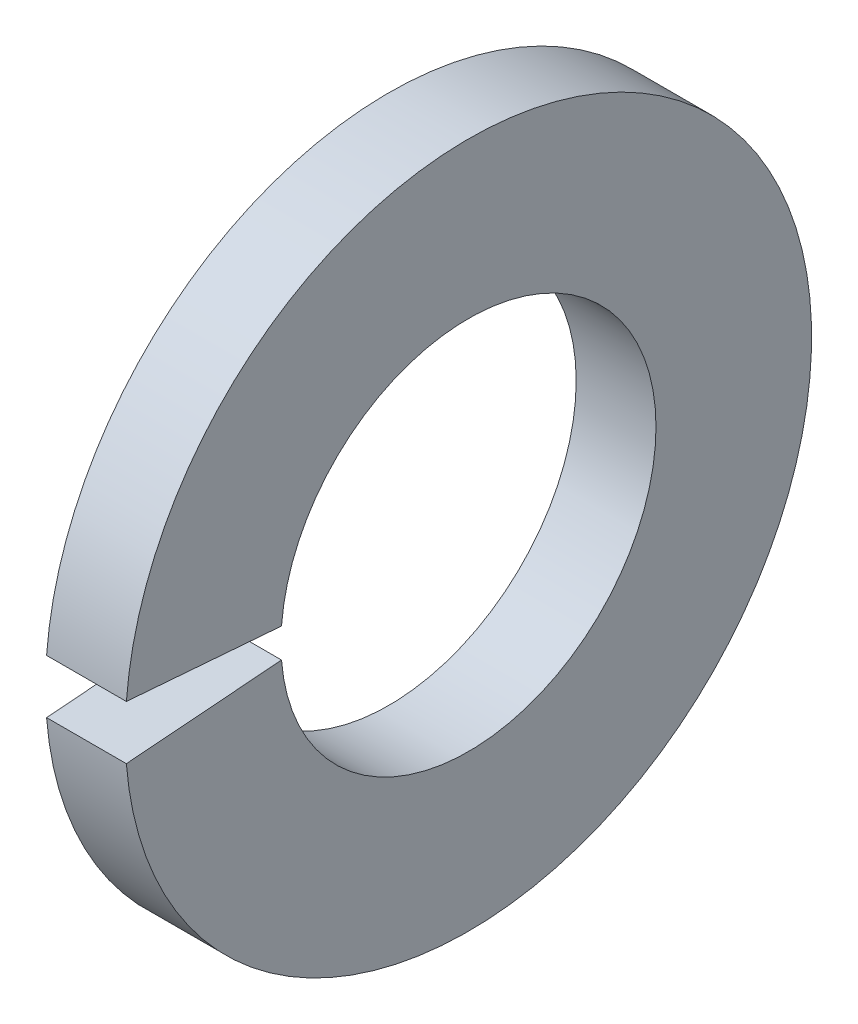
ISO-10303-21;
HEADER;
FILE_DESCRIPTION(('STEP AP214'),'2;1');
FILE_NAME('part.step','',(''),(''),'','','');
FILE_SCHEMA(('AUTOMOTIVE_DESIGN { 1 0 10303 214 1 1 1 1 }'));
ENDSEC;
DATA;
#1=APPLICATION_CONTEXT('core data for automotive mechanical design processes');
#2=APPLICATION_PROTOCOL_DEFINITION('international standard','automotive_design',2000,#1);
#3=PRODUCT_CONTEXT('',#1,'mechanical');
#4=PRODUCT('Part','Part','',(#3));
#5=PRODUCT_RELATED_PRODUCT_CATEGORY('part','',(#4));
#6=PRODUCT_DEFINITION_FORMATION('','',#4);
#7=PRODUCT_DEFINITION_CONTEXT('part definition',#1,'design');
#8=PRODUCT_DEFINITION('design','',#6,#7);
#9=PRODUCT_DEFINITION_SHAPE('','',#8);
#10=(LENGTH_UNIT() NAMED_UNIT(*) SI_UNIT(.MILLI.,.METRE.));
#11=(NAMED_UNIT(*) PLANE_ANGLE_UNIT() SI_UNIT($,.RADIAN.));
#12=(NAMED_UNIT(*) SI_UNIT($,.STERADIAN.) SOLID_ANGLE_UNIT());
#13=UNCERTAINTY_MEASURE_WITH_UNIT(LENGTH_MEASURE(1.E-05),#10,'distance_accuracy_value','');
#14=(GEOMETRIC_REPRESENTATION_CONTEXT(3) GLOBAL_UNCERTAINTY_ASSIGNED_CONTEXT((#13)) GLOBAL_UNIT_ASSIGNED_CONTEXT((#10,
#11,#12)) REPRESENTATION_CONTEXT('',''));
#15=CARTESIAN_POINT('',(0.,0.,0.));
#16=DIRECTION('',(0.,0.,1.));
#17=DIRECTION('',(1.,0.,0.));
#18=AXIS2_PLACEMENT_3D('',#15,#16,#17);
#19=CARTESIAN_POINT('',(-34.925,0.,0.));
#20=DIRECTION('',(-1.,0.,0.));
#21=DIRECTION('',(0.,0.,1.));
#22=AXIS2_PLACEMENT_3D('',#19,#20,#21);
#23=CYLINDRICAL_SURFACE('',#22,1.1938);
#24=CARTESIAN_POINT('',(0.,0.,0.));
#25=DIRECTION('',(-1.,0.,0.));
#26=DIRECTION('',(0.,0.,1.));
#27=AXIS2_PLACEMENT_3D('',#24,#25,#26);
#28=CIRCLE('',#27,1.1938);
#29=CARTESIAN_POINT('',(0.,0.0936644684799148,1.1901199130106));
#30=VERTEX_POINT('',#29);
#31=CARTESIAN_POINT('',(0.,-0.0936644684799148,1.1901199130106));
#32=VERTEX_POINT('',#31);
#33=EDGE_CURVE('E87',#30,#32,#28,.T.);
#34=ORIENTED_EDGE('',*,*,#33,.F.);
#35=DIRECTION('',(-1.,0.,0.));
#36=VECTOR('',#35,1.);
#37=CARTESIAN_POINT('',(-34.925,0.0936644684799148,1.1901199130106));
#38=LINE('',#37,#36);
#39=CARTESIAN_POINT('',(-0.508000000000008,0.0936644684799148,1.1901199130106));
#40=VERTEX_POINT('',#39);
#41=EDGE_CURVE('E101',#30,#40,#38,.T.);
#42=ORIENTED_EDGE('',*,*,#41,.T.);
#43=CARTESIAN_POINT('',(-0.508000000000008,0.,0.));
#44=DIRECTION('',(-1.,0.,0.));
#45=DIRECTION('',(0.,0.,1.));
#46=AXIS2_PLACEMENT_3D('',#43,#44,#45);
#47=CIRCLE('',#46,1.1938);
#48=CARTESIAN_POINT('',(-0.508000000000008,-0.0936644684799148,1.1901199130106));
#49=VERTEX_POINT('',#48);
#50=EDGE_CURVE('E89',#40,#49,#47,.T.);
#51=ORIENTED_EDGE('',*,*,#50,.T.);
#52=DIRECTION('',(-1.,0.,0.));
#53=VECTOR('',#52,1.);
#54=CARTESIAN_POINT('',(-34.925,-0.0936644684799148,1.1901199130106));
#55=LINE('',#54,#53);
#56=EDGE_CURVE('E57',#32,#49,#55,.T.);
#57=ORIENTED_EDGE('',*,*,#56,.F.);
#58=EDGE_LOOP('',(#34,#42,#51,#57));
#59=FACE_BOUND('',#58,.T.);
#60=ADVANCED_FACE('F36',(#59),#23,.F.);
#61=CARTESIAN_POINT('',(0.,1.19380000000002,0.));
#62=DIRECTION('',(-1.,0.,0.));
#63=DIRECTION('',(0.,0.,1.));
#64=AXIS2_PLACEMENT_3D('',#61,#62,#63);
#65=PLANE('',#64);
#66=CARTESIAN_POINT('',(0.,0.,0.));
#67=DIRECTION('',(-1.,0.,0.));
#68=DIRECTION('',(0.,0.,1.));
#69=AXIS2_PLACEMENT_3D('',#66,#67,#68);
#70=CIRCLE('',#69,2.1844);
#71=CARTESIAN_POINT('',(0.,0.171386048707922,2.17766622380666));
#72=VERTEX_POINT('',#71);
#73=CARTESIAN_POINT('',(0.,-0.171386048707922,2.17766622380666));
#74=VERTEX_POINT('',#73);
#75=EDGE_CURVE('E93',#72,#74,#70,.T.);
#76=ORIENTED_EDGE('',*,*,#75,.F.);
#77=DIRECTION('',(0.,0.0784590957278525,0.996917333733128));
#78=VECTOR('',#77,1.);
#79=CARTESIAN_POINT('',(0.,0.,0.));
#80=LINE('',#79,#78);
#81=EDGE_CURVE('E81',#30,#72,#80,.T.);
#82=ORIENTED_EDGE('',*,*,#81,.F.);
#83=ORIENTED_EDGE('',*,*,#33,.T.);
#84=DIRECTION('',(0.,-0.0784590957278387,0.996917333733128));
#85=VECTOR('',#84,1.);
#86=CARTESIAN_POINT('',(0.,0.,0.));
#87=LINE('',#86,#85);
#88=EDGE_CURVE('E73',#32,#74,#87,.T.);
#89=ORIENTED_EDGE('',*,*,#88,.T.);
#90=EDGE_LOOP('',(#76,#82,#83,#89));
#91=FACE_BOUND('',#90,.T.);
#92=ADVANCED_FACE('F92',(#91),#65,.F.);
#93=CARTESIAN_POINT('',(-34.925,0.,0.));
#94=DIRECTION('',(-1.,0.,0.));
#95=DIRECTION('',(0.,0.,1.));
#96=AXIS2_PLACEMENT_3D('',#93,#94,#95);
#97=CYLINDRICAL_SURFACE('',#96,2.1844);
#98=CARTESIAN_POINT('',(-0.508000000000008,0.,0.));
#99=DIRECTION('',(-1.,0.,0.));
#100=DIRECTION('',(0.,0.,1.));
#101=AXIS2_PLACEMENT_3D('',#98,#99,#100);
#102=CIRCLE('',#101,2.1844);
#103=CARTESIAN_POINT('',(-0.508000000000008,0.171386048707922,2.17766622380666));
#104=VERTEX_POINT('',#103);
#105=CARTESIAN_POINT('',(-0.508000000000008,-0.171386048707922,2.17766622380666));
#106=VERTEX_POINT('',#105);
#107=EDGE_CURVE('E95',#104,#106,#102,.T.);
#108=ORIENTED_EDGE('',*,*,#107,.F.);
#109=DIRECTION('',(-1.,0.,0.));
#110=VECTOR('',#109,1.);
#111=CARTESIAN_POINT('',(-34.925,0.171386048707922,2.17766622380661));
#112=LINE('',#111,#110);
#113=EDGE_CURVE('E50',#104,#72,#112,.F.);
#114=ORIENTED_EDGE('',*,*,#113,.T.);
#115=ORIENTED_EDGE('',*,*,#75,.T.);
#116=DIRECTION('',(-1.,0.,0.));
#117=VECTOR('',#116,1.);
#118=CARTESIAN_POINT('',(-34.925,-0.171386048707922,2.17766622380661));
#119=LINE('',#118,#117);
#120=EDGE_CURVE('E76',#106,#74,#119,.F.);
#121=ORIENTED_EDGE('',*,*,#120,.F.);
#122=EDGE_LOOP('',(#108,#114,#115,#121));
#123=FACE_BOUND('',#122,.T.);
#124=ADVANCED_FACE('F108',(#123),#97,.T.);
#125=CARTESIAN_POINT('',(-0.507999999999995,2.18439999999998,0.));
#126=DIRECTION('',(1.,0.,0.));
#127=DIRECTION('',(0.,0.,-1.));
#128=AXIS2_PLACEMENT_3D('',#125,#126,#127);
#129=PLANE('',#128);
#130=ORIENTED_EDGE('',*,*,#50,.F.);
#131=DIRECTION('',(0.,0.0784590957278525,0.996917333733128));
#132=VECTOR('',#131,1.);
#133=CARTESIAN_POINT('',(-0.507999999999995,0.0134467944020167,0.170857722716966));
#134=LINE('',#133,#132);
#135=EDGE_CURVE('E11',#40,#104,#134,.T.);
#136=ORIENTED_EDGE('',*,*,#135,.T.);
#137=ORIENTED_EDGE('',*,*,#107,.T.);
#138=DIRECTION('',(0.,-0.0784590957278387,0.996917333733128));
#139=VECTOR('',#138,1.);
#140=CARTESIAN_POINT('',(-0.507999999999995,0.0134467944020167,-0.170857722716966));
#141=LINE('',#140,#139);
#142=EDGE_CURVE('E43',#49,#106,#141,.T.);
#143=ORIENTED_EDGE('',*,*,#142,.F.);
#144=EDGE_LOOP('',(#130,#136,#137,#143));
#145=FACE_BOUND('',#144,.T.);
#146=ADVANCED_FACE('F110',(#145),#129,.F.);
#147=CARTESIAN_POINT('',(-0.508000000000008,0.,0.));
#148=DIRECTION('',(0.,0.996917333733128,0.0784590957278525));
#149=DIRECTION('',(0.,-0.0784590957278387,0.996917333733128));
#150=AXIS2_PLACEMENT_3D('',#147,#148,#149);
#151=PLANE('',#150);
#152=ORIENTED_EDGE('',*,*,#56,.T.);
#153=ORIENTED_EDGE('',*,*,#142,.T.);
#154=ORIENTED_EDGE('',*,*,#120,.T.);
#155=ORIENTED_EDGE('',*,*,#88,.F.);
#156=EDGE_LOOP('',(#152,#153,#154,#155));
#157=FACE_BOUND('',#156,.T.);
#158=ADVANCED_FACE('F74',(#157),#151,.T.);
#159=CARTESIAN_POINT('',(-0.508000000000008,0.,0.));
#160=DIRECTION('',(0.,0.996917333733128,-0.0784590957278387));
#161=DIRECTION('',(0.,0.0784590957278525,0.996917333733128));
#162=AXIS2_PLACEMENT_3D('',#159,#160,#161);
#163=PLANE('',#162);
#164=ORIENTED_EDGE('',*,*,#81,.T.);
#165=ORIENTED_EDGE('',*,*,#113,.F.);
#166=ORIENTED_EDGE('',*,*,#135,.F.);
#167=ORIENTED_EDGE('',*,*,#41,.F.);
#168=EDGE_LOOP('',(#164,#165,#166,#167));
#169=FACE_BOUND('',#168,.T.);
#170=ADVANCED_FACE('F105',(#169),#163,.F.);
#171=CLOSED_SHELL('',(#60,#92,#124,#146,#158,#170));
#172=MANIFOLD_SOLID_BREP('B2',#171);
#173=ADVANCED_BREP_SHAPE_REPRESENTATION('',(#18,#172),#14);
#174=SHAPE_DEFINITION_REPRESENTATION(#9,#173);
ENDSEC;
END-ISO-10303-21;
